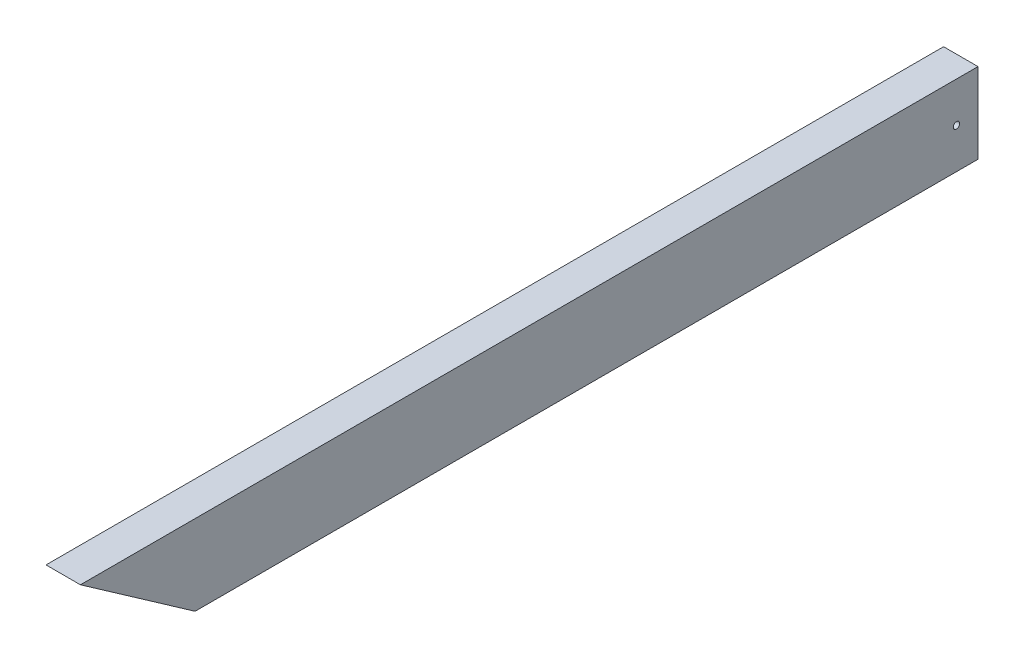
from build123d import *

# Parameters (mm, degrees)
SKETCH1_W                       = 38.1
SKETCH1_H                       = 88.9
BOSS_EXTRUDE1_DEPTH             = 1143
F_9_32_0_28125_DIAMETER_HOLE1_D = 7.14375
SKETCH5_R                       = 3.571875
CUT_EXTRUDE1_DEPTH              = 1145.498323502


with BuildPart() as part:
    # Sketch1 → Boss-Extrude1 (new body)
    with BuildSketch(Plane.XY):
        Rectangle(SKETCH1_W, SKETCH1_H)
    extrude(amount=BOSS_EXTRUDE1_DEPTH)

    # 9_32 _0.28125_ Diameter Hole1 (through all)
    with Locations(Plane(origin=(19.05, 0, 0), x_dir=(0, 0, -1), z_dir=(1, 0, 0))):
        with Locations((-1128.7125, 0), (-23.8125, 0)):
            Hole(F_9_32_0_28125_DIAMETER_HOLE1_D / 2)

    # Sketch5 → Cut-Extrude1 (cut, through all)
    with BuildSketch(Plane(origin=(19.05, 0, 0), x_dir=(0, 0, -1), z_dir=(1, 0, 0))):
        Polygon((-866.812642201, -44.45), (-993.775, 44.45), (-1143, 44.45), (-1143, -44.45), (-869.95, -44.45), align=None)
        with Locations((-1128.7125, 0)):
            Circle(SKETCH5_R, mode=Mode.SUBTRACT)
    extrude(amount=-CUT_EXTRUDE1_DEPTH, mode=Mode.SUBTRACT)


solid = part.part
